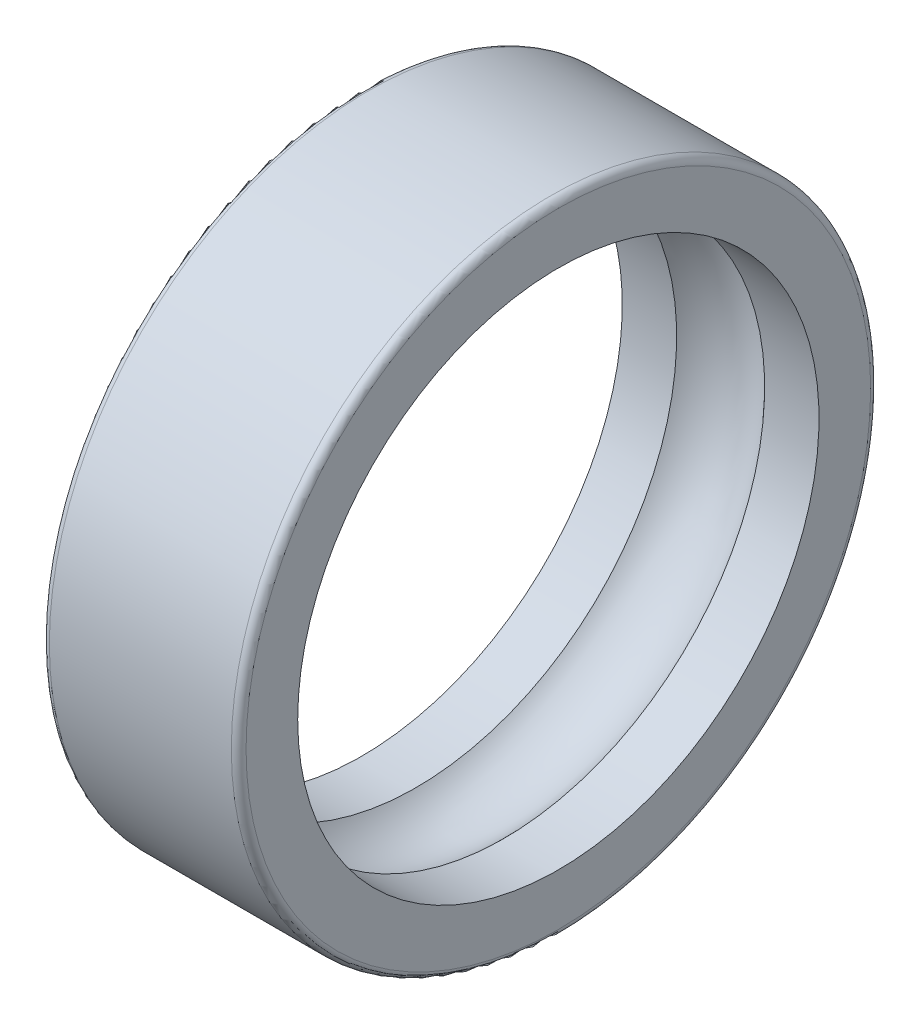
ISO-10303-21;
HEADER;
FILE_DESCRIPTION(('STEP AP214'),'2;1');
FILE_NAME('part.step','',(''),(''),'','','');
FILE_SCHEMA(('AUTOMOTIVE_DESIGN { 1 0 10303 214 1 1 1 1 }'));
ENDSEC;
DATA;
#1=APPLICATION_CONTEXT('core data for automotive mechanical design processes');
#2=APPLICATION_PROTOCOL_DEFINITION('international standard','automotive_design',2000,#1);
#3=PRODUCT_CONTEXT('',#1,'mechanical');
#4=PRODUCT('Part','Part','',(#3));
#5=PRODUCT_RELATED_PRODUCT_CATEGORY('part','',(#4));
#6=PRODUCT_DEFINITION_FORMATION('','',#4);
#7=PRODUCT_DEFINITION_CONTEXT('part definition',#1,'design');
#8=PRODUCT_DEFINITION('design','',#6,#7);
#9=PRODUCT_DEFINITION_SHAPE('','',#8);
#10=(LENGTH_UNIT() NAMED_UNIT(*) SI_UNIT(.MILLI.,.METRE.));
#11=(NAMED_UNIT(*) PLANE_ANGLE_UNIT() SI_UNIT($,.RADIAN.));
#12=(NAMED_UNIT(*) SI_UNIT($,.STERADIAN.) SOLID_ANGLE_UNIT());
#13=UNCERTAINTY_MEASURE_WITH_UNIT(LENGTH_MEASURE(1.E-05),#10,'distance_accuracy_value','');
#14=(GEOMETRIC_REPRESENTATION_CONTEXT(3) GLOBAL_UNCERTAINTY_ASSIGNED_CONTEXT((#13)) GLOBAL_UNIT_ASSIGNED_CONTEXT((#10,
#11,#12)) REPRESENTATION_CONTEXT('',''));
#15=CARTESIAN_POINT('',(0.,0.,0.));
#16=DIRECTION('',(0.,0.,1.));
#17=DIRECTION('',(1.,0.,0.));
#18=AXIS2_PLACEMENT_3D('',#15,#16,#17);
#19=CARTESIAN_POINT('',(0.300000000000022,0.,0.));
#20=DIRECTION('',(-1.,0.,0.));
#21=DIRECTION('',(0.,0.,1.));
#22=AXIS2_PLACEMENT_3D('',#19,#20,#21);
#23=TOROIDAL_SURFACE('',#22,12.7,0.3);
#24=CARTESIAN_POINT('',(0.,0.,0.));
#25=DIRECTION('',(-1.,0.,0.));
#26=DIRECTION('',(0.,0.,1.));
#27=AXIS2_PLACEMENT_3D('',#24,#25,#26);
#28=CIRCLE('',#27,12.7);
#29=CARTESIAN_POINT('',(0.,0.,12.7));
#30=VERTEX_POINT('',#29);
#31=EDGE_CURVE('E10',#30,#30,#28,.T.);
#32=ORIENTED_EDGE('',*,*,#31,.F.);
#33=EDGE_LOOP('',(#32));
#34=FACE_BOUND('',#33,.T.);
#35=CARTESIAN_POINT('',(0.300000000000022,0.,0.));
#36=DIRECTION('',(-1.,0.,0.));
#37=DIRECTION('',(0.,0.,1.));
#38=AXIS2_PLACEMENT_3D('',#35,#36,#37);
#39=CIRCLE('',#38,13.);
#40=CARTESIAN_POINT('',(0.300000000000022,0.,13.));
#41=VERTEX_POINT('',#40);
#42=EDGE_CURVE('E56',#41,#41,#39,.T.);
#43=ORIENTED_EDGE('',*,*,#42,.T.);
#44=EDGE_LOOP('',(#43));
#45=FACE_BOUND('',#44,.T.);
#46=ADVANCED_FACE('F28',(#34,#45),#23,.T.);
#47=CARTESIAN_POINT('',(0.,0.,-12.7));
#48=DIRECTION('',(1.,0.,0.));
#49=DIRECTION('',(0.,0.,-1.));
#50=AXIS2_PLACEMENT_3D('',#47,#48,#49);
#51=PLANE('',#50);
#52=CARTESIAN_POINT('',(0.,0.,0.));
#53=DIRECTION('',(-1.,0.,0.));
#54=DIRECTION('',(0.,0.,1.));
#55=AXIS2_PLACEMENT_3D('',#52,#53,#54);
#56=CIRCLE('',#55,10.6);
#57=CARTESIAN_POINT('',(0.,0.,10.6));
#58=VERTEX_POINT('',#57);
#59=EDGE_CURVE('E34',#58,#58,#56,.T.);
#60=ORIENTED_EDGE('',*,*,#59,.F.);
#61=EDGE_LOOP('',(#60));
#62=FACE_BOUND('',#61,.T.);
#63=ORIENTED_EDGE('',*,*,#31,.T.);
#64=EDGE_LOOP('',(#63));
#65=FACE_BOUND('',#64,.T.);
#66=ADVANCED_FACE('F93',(#62,#65),#51,.F.);
#67=CARTESIAN_POINT('',(0.,0.,0.));
#68=DIRECTION('',(-1.,0.,0.));
#69=DIRECTION('',(0.,0.,1.));
#70=AXIS2_PLACEMENT_3D('',#67,#68,#69);
#71=CYLINDRICAL_SURFACE('',#70,10.6);
#72=CARTESIAN_POINT('',(2.21114561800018,0.,0.));
#73=DIRECTION('',(-1.,0.,0.));
#74=DIRECTION('',(0.,0.,1.));
#75=AXIS2_PLACEMENT_3D('',#72,#73,#74);
#76=CIRCLE('',#75,10.6);
#77=CARTESIAN_POINT('',(2.21114561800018,0.,10.6000000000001));
#78=VERTEX_POINT('',#77);
#79=EDGE_CURVE('E38',#78,#78,#76,.T.);
#80=ORIENTED_EDGE('',*,*,#79,.F.);
#81=EDGE_LOOP('',(#80));
#82=FACE_BOUND('',#81,.T.);
#83=ORIENTED_EDGE('',*,*,#59,.T.);
#84=EDGE_LOOP('',(#83));
#85=FACE_BOUND('',#84,.T.);
#86=ADVANCED_FACE('F88',(#82,#85),#71,.F.);
#87=CARTESIAN_POINT('',(4.,0.,0.));
#88=DIRECTION('',(-1.,0.,0.));
#89=DIRECTION('',(0.,0.,1.));
#90=AXIS2_PLACEMENT_3D('',#87,#88,#89);
#91=TOROIDAL_SURFACE('',#90,9.,2.4);
#92=CARTESIAN_POINT('',(5.78885438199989,0.,0.));
#93=DIRECTION('',(-1.,0.,0.));
#94=DIRECTION('',(0.,0.,1.));
#95=AXIS2_PLACEMENT_3D('',#92,#93,#94);
#96=CIRCLE('',#95,10.6);
#97=CARTESIAN_POINT('',(5.78885438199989,0.,10.6));
#98=VERTEX_POINT('',#97);
#99=EDGE_CURVE('E42',#98,#98,#96,.T.);
#100=ORIENTED_EDGE('',*,*,#99,.F.);
#101=EDGE_LOOP('',(#100));
#102=FACE_BOUND('',#101,.T.);
#103=ORIENTED_EDGE('',*,*,#79,.T.);
#104=EDGE_LOOP('',(#103));
#105=FACE_BOUND('',#104,.T.);
#106=ADVANCED_FACE('F82',(#102,#105),#91,.F.);
#107=CARTESIAN_POINT('',(0.,0.,0.));
#108=DIRECTION('',(-1.,0.,0.));
#109=DIRECTION('',(0.,0.,1.));
#110=AXIS2_PLACEMENT_3D('',#107,#108,#109);
#111=CYLINDRICAL_SURFACE('',#110,10.6);
#112=CARTESIAN_POINT('',(7.99999999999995,0.,0.));
#113=DIRECTION('',(-1.,0.,0.));
#114=DIRECTION('',(0.,0.,1.));
#115=AXIS2_PLACEMENT_3D('',#112,#113,#114);
#116=CIRCLE('',#115,10.6);
#117=CARTESIAN_POINT('',(7.99999999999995,0.,10.6));
#118=VERTEX_POINT('',#117);
#119=EDGE_CURVE('E47',#118,#118,#116,.T.);
#120=ORIENTED_EDGE('',*,*,#119,.F.);
#121=EDGE_LOOP('',(#120));
#122=FACE_BOUND('',#121,.T.);
#123=ORIENTED_EDGE('',*,*,#99,.T.);
#124=EDGE_LOOP('',(#123));
#125=FACE_BOUND('',#124,.T.);
#126=ADVANCED_FACE('F76',(#122,#125),#111,.F.);
#127=CARTESIAN_POINT('',(8.00000000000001,0.,-12.7));
#128=DIRECTION('',(-1.,0.,0.));
#129=DIRECTION('',(0.,0.,1.));
#130=AXIS2_PLACEMENT_3D('',#127,#128,#129);
#131=PLANE('',#130);
#132=CARTESIAN_POINT('',(7.99999999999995,0.,0.));
#133=DIRECTION('',(-1.,0.,0.));
#134=DIRECTION('',(0.,0.,1.));
#135=AXIS2_PLACEMENT_3D('',#132,#133,#134);
#136=CIRCLE('',#135,12.7);
#137=CARTESIAN_POINT('',(7.99999999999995,0.,12.7));
#138=VERTEX_POINT('',#137);
#139=EDGE_CURVE('E50',#138,#138,#136,.T.);
#140=ORIENTED_EDGE('',*,*,#139,.F.);
#141=EDGE_LOOP('',(#140));
#142=FACE_BOUND('',#141,.T.);
#143=ORIENTED_EDGE('',*,*,#119,.T.);
#144=EDGE_LOOP('',(#143));
#145=FACE_BOUND('',#144,.T.);
#146=ADVANCED_FACE('F70',(#142,#145),#131,.F.);
#147=CARTESIAN_POINT('',(7.69999999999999,0.,0.));
#148=DIRECTION('',(-1.,0.,0.));
#149=DIRECTION('',(0.,0.,1.));
#150=AXIS2_PLACEMENT_3D('',#147,#148,#149);
#151=TOROIDAL_SURFACE('',#150,12.7,0.299999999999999);
#152=CARTESIAN_POINT('',(7.69999999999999,0.,0.));
#153=DIRECTION('',(-1.,0.,0.));
#154=DIRECTION('',(0.,0.,1.));
#155=AXIS2_PLACEMENT_3D('',#152,#153,#154);
#156=CIRCLE('',#155,13.);
#157=CARTESIAN_POINT('',(7.69999999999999,0.,13.));
#158=VERTEX_POINT('',#157);
#159=EDGE_CURVE('E53',#158,#158,#156,.T.);
#160=ORIENTED_EDGE('',*,*,#159,.F.);
#161=EDGE_LOOP('',(#160));
#162=FACE_BOUND('',#161,.T.);
#163=ORIENTED_EDGE('',*,*,#139,.T.);
#164=EDGE_LOOP('',(#163));
#165=FACE_BOUND('',#164,.T.);
#166=ADVANCED_FACE('F64',(#162,#165),#151,.T.);
#167=CARTESIAN_POINT('',(0.,0.,0.));
#168=DIRECTION('',(-1.,0.,0.));
#169=DIRECTION('',(0.,0.,1.));
#170=AXIS2_PLACEMENT_3D('',#167,#168,#169);
#171=CYLINDRICAL_SURFACE('',#170,13.);
#172=ORIENTED_EDGE('',*,*,#42,.F.);
#173=EDGE_LOOP('',(#172));
#174=FACE_BOUND('',#173,.T.);
#175=ORIENTED_EDGE('',*,*,#159,.T.);
#176=EDGE_LOOP('',(#175));
#177=FACE_BOUND('',#176,.T.);
#178=ADVANCED_FACE('F61',(#174,#177),#171,.T.);
#179=CLOSED_SHELL('',(#46,#66,#86,#106,#126,#146,#166,#178));
#180=MANIFOLD_SOLID_BREP('B2',#179);
#181=ADVANCED_BREP_SHAPE_REPRESENTATION('',(#18,#180),#14);
#182=SHAPE_DEFINITION_REPRESENTATION(#9,#181);
ENDSEC;
END-ISO-10303-21;
